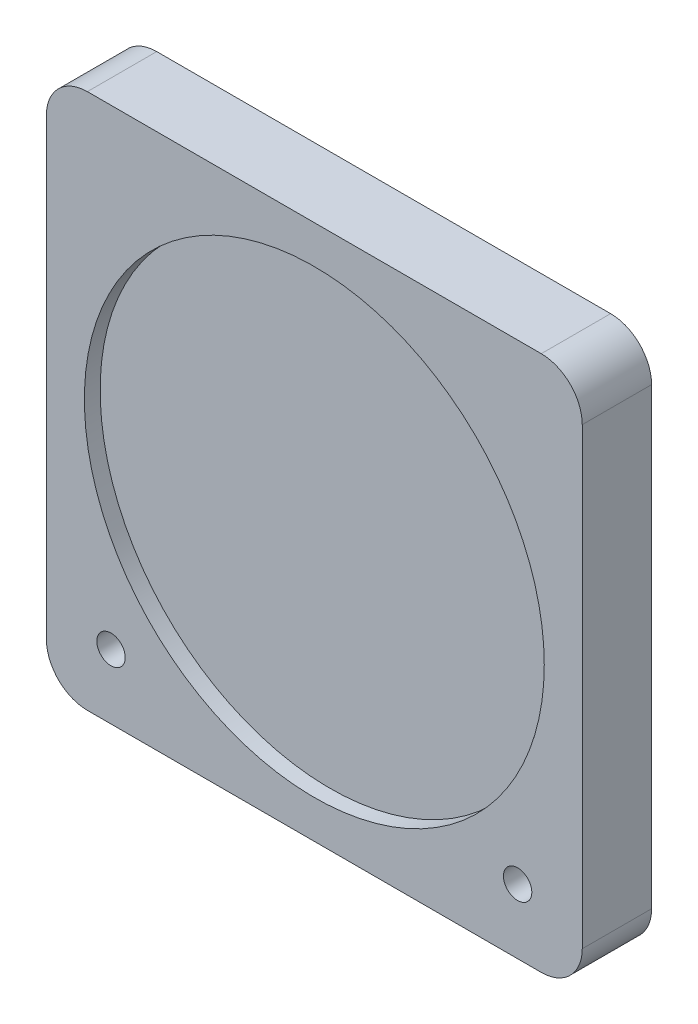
ISO-10303-21;
HEADER;
FILE_DESCRIPTION(('STEP AP214'),'2;1');
FILE_NAME('part.step','',(''),(''),'','','');
FILE_SCHEMA(('AUTOMOTIVE_DESIGN { 1 0 10303 214 1 1 1 1 }'));
ENDSEC;
DATA;
#1=APPLICATION_CONTEXT('core data for automotive mechanical design processes');
#2=APPLICATION_PROTOCOL_DEFINITION('international standard','automotive_design',2000,#1);
#3=PRODUCT_CONTEXT('',#1,'mechanical');
#4=PRODUCT('Part','Part','',(#3));
#5=PRODUCT_RELATED_PRODUCT_CATEGORY('part','',(#4));
#6=PRODUCT_DEFINITION_FORMATION('','',#4);
#7=PRODUCT_DEFINITION_CONTEXT('part definition',#1,'design');
#8=PRODUCT_DEFINITION('design','',#6,#7);
#9=PRODUCT_DEFINITION_SHAPE('','',#8);
#10=(LENGTH_UNIT() NAMED_UNIT(*) SI_UNIT(.MILLI.,.METRE.));
#11=(NAMED_UNIT(*) PLANE_ANGLE_UNIT() SI_UNIT($,.RADIAN.));
#12=(NAMED_UNIT(*) SI_UNIT($,.STERADIAN.) SOLID_ANGLE_UNIT());
#13=UNCERTAINTY_MEASURE_WITH_UNIT(LENGTH_MEASURE(1.E-05),#10,'distance_accuracy_value','');
#14=(GEOMETRIC_REPRESENTATION_CONTEXT(3) GLOBAL_UNCERTAINTY_ASSIGNED_CONTEXT((#13)) GLOBAL_UNIT_ASSIGNED_CONTEXT((#10,
#11,#12)) REPRESENTATION_CONTEXT('',''));
#15=CARTESIAN_POINT('',(0.,0.,0.));
#16=DIRECTION('',(0.,0.,1.));
#17=DIRECTION('',(1.,0.,0.));
#18=AXIS2_PLACEMENT_3D('',#15,#16,#17);
#19=CARTESIAN_POINT('',(0.,0.,22.));
#20=DIRECTION('',(1.,0.,0.));
#21=DIRECTION('',(0.,0.,-1.));
#22=AXIS2_PLACEMENT_3D('',#19,#20,#21);
#23=PLANE('',#22);
#24=DIRECTION('',(0.,-1.,0.));
#25=VECTOR('',#24,1.);
#26=CARTESIAN_POINT('',(0.,0.,0.));
#27=LINE('',#26,#25);
#28=CARTESIAN_POINT('',(0.,157.,0.));
#29=VERTEX_POINT('',#28);
#30=CARTESIAN_POINT('',(0.,13.,0.));
#31=VERTEX_POINT('',#30);
#32=EDGE_CURVE('E123',#29,#31,#27,.T.);
#33=ORIENTED_EDGE('',*,*,#32,.T.);
#34=DIRECTION('',(0.,0.,-1.));
#35=VECTOR('',#34,1.);
#36=CARTESIAN_POINT('',(0.,13.,22.));
#37=LINE('',#36,#35);
#38=CARTESIAN_POINT('',(0.,13.,22.));
#39=VERTEX_POINT('',#38);
#40=EDGE_CURVE('E101',#31,#39,#37,.F.);
#41=ORIENTED_EDGE('',*,*,#40,.T.);
#42=DIRECTION('',(0.,-1.,0.));
#43=VECTOR('',#42,1.);
#44=CARTESIAN_POINT('',(0.,0.,22.));
#45=LINE('',#44,#43);
#46=CARTESIAN_POINT('',(0.,157.,22.));
#47=VERTEX_POINT('',#46);
#48=EDGE_CURVE('E133',#47,#39,#45,.T.);
#49=ORIENTED_EDGE('',*,*,#48,.F.);
#50=DIRECTION('',(0.,0.,-1.));
#51=VECTOR('',#50,1.);
#52=CARTESIAN_POINT('',(0.,157.,22.));
#53=LINE('',#52,#51);
#54=EDGE_CURVE('E106',#47,#29,#53,.T.);
#55=ORIENTED_EDGE('',*,*,#54,.T.);
#56=EDGE_LOOP('',(#33,#41,#49,#55));
#57=FACE_BOUND('',#56,.T.);
#58=ADVANCED_FACE('F31',(#57),#23,.F.);
#59=CARTESIAN_POINT('',(0.,0.,22.));
#60=DIRECTION('',(0.,1.,0.));
#61=DIRECTION('',(0.,0.,1.));
#62=AXIS2_PLACEMENT_3D('',#59,#60,#61);
#63=PLANE('',#62);
#64=DIRECTION('',(1.,0.,0.));
#65=VECTOR('',#64,1.);
#66=CARTESIAN_POINT('',(0.,0.,22.));
#67=LINE('',#66,#65);
#68=CARTESIAN_POINT('',(13.,0.,22.));
#69=VERTEX_POINT('',#68);
#70=CARTESIAN_POINT('',(157.,0.,22.));
#71=VERTEX_POINT('',#70);
#72=EDGE_CURVE('E116',#69,#71,#67,.T.);
#73=ORIENTED_EDGE('',*,*,#72,.F.);
#74=DIRECTION('',(0.,0.,-1.));
#75=VECTOR('',#74,1.);
#76=CARTESIAN_POINT('',(13.,0.,22.));
#77=LINE('',#76,#75);
#78=CARTESIAN_POINT('',(13.,0.,0.));
#79=VERTEX_POINT('',#78);
#80=EDGE_CURVE('E100',#69,#79,#77,.T.);
#81=ORIENTED_EDGE('',*,*,#80,.T.);
#82=DIRECTION('',(1.,0.,0.));
#83=VECTOR('',#82,1.);
#84=CARTESIAN_POINT('',(0.,0.,0.));
#85=LINE('',#84,#83);
#86=CARTESIAN_POINT('',(157.,0.,0.));
#87=VERTEX_POINT('',#86);
#88=EDGE_CURVE('E113',#79,#87,#85,.T.);
#89=ORIENTED_EDGE('',*,*,#88,.T.);
#90=DIRECTION('',(0.,0.,-1.));
#91=VECTOR('',#90,1.);
#92=CARTESIAN_POINT('',(157.,0.,22.));
#93=LINE('',#92,#91);
#94=EDGE_CURVE('E118',#87,#71,#93,.F.);
#95=ORIENTED_EDGE('',*,*,#94,.T.);
#96=EDGE_LOOP('',(#73,#81,#89,#95));
#97=FACE_BOUND('',#96,.T.);
#98=ADVANCED_FACE('F112',(#97),#63,.F.);
#99=CARTESIAN_POINT('',(170.,0.,22.));
#100=DIRECTION('',(-1.,0.,0.));
#101=DIRECTION('',(0.,0.,1.));
#102=AXIS2_PLACEMENT_3D('',#99,#100,#101);
#103=PLANE('',#102);
#104=DIRECTION('',(0.,1.,0.));
#105=VECTOR('',#104,1.);
#106=CARTESIAN_POINT('',(170.,0.,22.));
#107=LINE('',#106,#105);
#108=CARTESIAN_POINT('',(170.,13.,22.));
#109=VERTEX_POINT('',#108);
#110=CARTESIAN_POINT('',(170.,157.,22.));
#111=VERTEX_POINT('',#110);
#112=EDGE_CURVE('E167',#109,#111,#107,.T.);
#113=ORIENTED_EDGE('',*,*,#112,.F.);
#114=DIRECTION('',(0.,0.,-1.));
#115=VECTOR('',#114,1.);
#116=CARTESIAN_POINT('',(170.,13.,22.));
#117=LINE('',#116,#115);
#118=CARTESIAN_POINT('',(170.,13.,0.));
#119=VERTEX_POINT('',#118);
#120=EDGE_CURVE('E152',#109,#119,#117,.T.);
#121=ORIENTED_EDGE('',*,*,#120,.T.);
#122=DIRECTION('',(0.,1.,0.));
#123=VECTOR('',#122,1.);
#124=CARTESIAN_POINT('',(170.,0.,0.));
#125=LINE('',#124,#123);
#126=CARTESIAN_POINT('',(170.,157.,0.));
#127=VERTEX_POINT('',#126);
#128=EDGE_CURVE('E122',#119,#127,#125,.T.);
#129=ORIENTED_EDGE('',*,*,#128,.T.);
#130=DIRECTION('',(0.,0.,-1.));
#131=VECTOR('',#130,1.);
#132=CARTESIAN_POINT('',(170.,157.,22.));
#133=LINE('',#132,#131);
#134=EDGE_CURVE('E150',#127,#111,#133,.F.);
#135=ORIENTED_EDGE('',*,*,#134,.T.);
#136=EDGE_LOOP('',(#113,#121,#129,#135));
#137=FACE_BOUND('',#136,.T.);
#138=ADVANCED_FACE('F182',(#137),#103,.F.);
#139=CARTESIAN_POINT('',(0.,170.,22.));
#140=DIRECTION('',(0.,-1.,0.));
#141=DIRECTION('',(0.,0.,-1.));
#142=AXIS2_PLACEMENT_3D('',#139,#140,#141);
#143=PLANE('',#142);
#144=DIRECTION('',(-1.,0.,0.));
#145=VECTOR('',#144,1.);
#146=CARTESIAN_POINT('',(0.,170.,0.));
#147=LINE('',#146,#145);
#148=CARTESIAN_POINT('',(157.,170.,0.));
#149=VERTEX_POINT('',#148);
#150=CARTESIAN_POINT('',(13.,170.,0.));
#151=VERTEX_POINT('',#150);
#152=EDGE_CURVE('E126',#149,#151,#147,.T.);
#153=ORIENTED_EDGE('',*,*,#152,.T.);
#154=DIRECTION('',(0.,0.,-1.));
#155=VECTOR('',#154,1.);
#156=CARTESIAN_POINT('',(13.,170.,22.));
#157=LINE('',#156,#155);
#158=CARTESIAN_POINT('',(13.,170.,22.));
#159=VERTEX_POINT('',#158);
#160=EDGE_CURVE('E11',#151,#159,#157,.F.);
#161=ORIENTED_EDGE('',*,*,#160,.T.);
#162=DIRECTION('',(-1.,0.,0.));
#163=VECTOR('',#162,1.);
#164=CARTESIAN_POINT('',(0.,170.,22.));
#165=LINE('',#164,#163);
#166=CARTESIAN_POINT('',(157.,170.,22.));
#167=VERTEX_POINT('',#166);
#168=EDGE_CURVE('E134',#167,#159,#165,.T.);
#169=ORIENTED_EDGE('',*,*,#168,.F.);
#170=DIRECTION('',(0.,0.,-1.));
#171=VECTOR('',#170,1.);
#172=CARTESIAN_POINT('',(157.,170.,22.));
#173=LINE('',#172,#171);
#174=EDGE_CURVE('E39',#167,#149,#173,.T.);
#175=ORIENTED_EDGE('',*,*,#174,.T.);
#176=EDGE_LOOP('',(#153,#161,#169,#175));
#177=FACE_BOUND('',#176,.T.);
#178=ADVANCED_FACE('F157',(#177),#143,.F.);
#179=CARTESIAN_POINT('',(0.,170.,22.));
#180=DIRECTION('',(0.,0.,-1.));
#181=DIRECTION('',(-1.,0.,0.));
#182=AXIS2_PLACEMENT_3D('',#179,#180,#181);
#183=PLANE('',#182);
#184=CARTESIAN_POINT('',(85.,85.,22.));
#185=DIRECTION('',(0.,0.,1.));
#186=DIRECTION('',(1.,0.,0.));
#187=AXIS2_PLACEMENT_3D('',#184,#185,#186);
#188=CIRCLE('',#187,72.95);
#189=CARTESIAN_POINT('',(157.95,85.,22.));
#190=VERTEX_POINT('',#189);
#191=EDGE_CURVE('E297',#190,#190,#188,.T.);
#192=ORIENTED_EDGE('',*,*,#191,.F.);
#193=EDGE_LOOP('',(#192));
#194=FACE_BOUND('',#193,.T.);
#195=CARTESIAN_POINT('',(20.5,20.5,22.));
#196=DIRECTION('',(0.,0.,1.));
#197=DIRECTION('',(1.,0.,0.));
#198=AXIS2_PLACEMENT_3D('',#195,#196,#197);
#199=CIRCLE('',#198,4.5);
#200=CARTESIAN_POINT('',(25.,20.5,22.));
#201=VERTEX_POINT('',#200);
#202=EDGE_CURVE('E296',#201,#201,#199,.T.);
#203=ORIENTED_EDGE('',*,*,#202,.F.);
#204=EDGE_LOOP('',(#203));
#205=FACE_BOUND('',#204,.T.);
#206=CARTESIAN_POINT('',(149.5,20.5,22.));
#207=DIRECTION('',(0.,0.,1.));
#208=DIRECTION('',(1.,0.,0.));
#209=AXIS2_PLACEMENT_3D('',#206,#207,#208);
#210=CIRCLE('',#209,4.5);
#211=CARTESIAN_POINT('',(154.,20.5,22.));
#212=VERTEX_POINT('',#211);
#213=EDGE_CURVE('E306',#212,#212,#210,.T.);
#214=ORIENTED_EDGE('',*,*,#213,.F.);
#215=EDGE_LOOP('',(#214));
#216=FACE_BOUND('',#215,.T.);
#217=ORIENTED_EDGE('',*,*,#48,.T.);
#218=CARTESIAN_POINT('',(13.,13.,22.));
#219=DIRECTION('',(0.,0.,-1.));
#220=DIRECTION('',(-1.,0.,0.));
#221=AXIS2_PLACEMENT_3D('',#218,#219,#220);
#222=CIRCLE('',#221,13.);
#223=EDGE_CURVE('E148',#39,#69,#222,.F.);
#224=ORIENTED_EDGE('',*,*,#223,.T.);
#225=ORIENTED_EDGE('',*,*,#72,.T.);
#226=CARTESIAN_POINT('',(157.,13.,22.));
#227=DIRECTION('',(0.,0.,-1.));
#228=DIRECTION('',(-1.,0.,0.));
#229=AXIS2_PLACEMENT_3D('',#226,#227,#228);
#230=CIRCLE('',#229,13.);
#231=EDGE_CURVE('E146',#71,#109,#230,.F.);
#232=ORIENTED_EDGE('',*,*,#231,.T.);
#233=ORIENTED_EDGE('',*,*,#112,.T.);
#234=CARTESIAN_POINT('',(157.,157.,22.));
#235=DIRECTION('',(0.,0.,-1.));
#236=DIRECTION('',(-1.,0.,0.));
#237=AXIS2_PLACEMENT_3D('',#234,#235,#236);
#238=CIRCLE('',#237,13.);
#239=EDGE_CURVE('E51',#111,#167,#238,.F.);
#240=ORIENTED_EDGE('',*,*,#239,.T.);
#241=ORIENTED_EDGE('',*,*,#168,.T.);
#242=CARTESIAN_POINT('',(13.,157.,22.));
#243=DIRECTION('',(0.,0.,-1.));
#244=DIRECTION('',(-1.,0.,0.));
#245=AXIS2_PLACEMENT_3D('',#242,#243,#244);
#246=CIRCLE('',#245,13.);
#247=EDGE_CURVE('E144',#159,#47,#246,.F.);
#248=ORIENTED_EDGE('',*,*,#247,.T.);
#249=EDGE_LOOP('',(#217,#224,#225,#232,#233,#240,#241,#248));
#250=FACE_BOUND('',#249,.T.);
#251=ADVANCED_FACE('F172',(#194,#205,#216,#250),#183,.F.);
#252=CARTESIAN_POINT('',(0.,170.,0.));
#253=DIRECTION('',(0.,0.,-1.));
#254=DIRECTION('',(-1.,0.,0.));
#255=AXIS2_PLACEMENT_3D('',#252,#253,#254);
#256=PLANE('',#255);
#257=CARTESIAN_POINT('',(20.5,20.5,0.));
#258=DIRECTION('',(0.,0.,-1.));
#259=DIRECTION('',(-1.,0.,0.));
#260=AXIS2_PLACEMENT_3D('',#257,#258,#259);
#261=CIRCLE('',#260,4.5);
#262=CARTESIAN_POINT('',(16.,20.5,0.));
#263=VERTEX_POINT('',#262);
#264=EDGE_CURVE('E300',#263,#263,#261,.T.);
#265=ORIENTED_EDGE('',*,*,#264,.F.);
#266=EDGE_LOOP('',(#265));
#267=FACE_BOUND('',#266,.T.);
#268=CARTESIAN_POINT('',(149.5,20.5,0.));
#269=DIRECTION('',(0.,0.,-1.));
#270=DIRECTION('',(-1.,0.,0.));
#271=AXIS2_PLACEMENT_3D('',#268,#269,#270);
#272=CIRCLE('',#271,4.5);
#273=CARTESIAN_POINT('',(145.,20.5,0.));
#274=VERTEX_POINT('',#273);
#275=EDGE_CURVE('E128',#274,#274,#272,.T.);
#276=ORIENTED_EDGE('',*,*,#275,.F.);
#277=EDGE_LOOP('',(#276));
#278=FACE_BOUND('',#277,.T.);
#279=ORIENTED_EDGE('',*,*,#88,.F.);
#280=CARTESIAN_POINT('',(13.,13.,0.));
#281=DIRECTION('',(0.,0.,-1.));
#282=DIRECTION('',(-1.,0.,0.));
#283=AXIS2_PLACEMENT_3D('',#280,#281,#282);
#284=CIRCLE('',#283,13.);
#285=EDGE_CURVE('E96',#79,#31,#284,.T.);
#286=ORIENTED_EDGE('',*,*,#285,.T.);
#287=ORIENTED_EDGE('',*,*,#32,.F.);
#288=CARTESIAN_POINT('',(13.,157.,0.));
#289=DIRECTION('',(0.,0.,-1.));
#290=DIRECTION('',(-1.,0.,0.));
#291=AXIS2_PLACEMENT_3D('',#288,#289,#290);
#292=CIRCLE('',#291,13.);
#293=EDGE_CURVE('E137',#29,#151,#292,.T.);
#294=ORIENTED_EDGE('',*,*,#293,.T.);
#295=ORIENTED_EDGE('',*,*,#152,.F.);
#296=CARTESIAN_POINT('',(157.,157.,0.));
#297=DIRECTION('',(0.,0.,-1.));
#298=DIRECTION('',(-1.,0.,0.));
#299=AXIS2_PLACEMENT_3D('',#296,#297,#298);
#300=CIRCLE('',#299,13.);
#301=EDGE_CURVE('E117',#149,#127,#300,.T.);
#302=ORIENTED_EDGE('',*,*,#301,.T.);
#303=ORIENTED_EDGE('',*,*,#128,.F.);
#304=CARTESIAN_POINT('',(157.,13.,0.));
#305=DIRECTION('',(0.,0.,-1.));
#306=DIRECTION('',(-1.,0.,0.));
#307=AXIS2_PLACEMENT_3D('',#304,#305,#306);
#308=CIRCLE('',#307,13.);
#309=EDGE_CURVE('E107',#119,#87,#308,.T.);
#310=ORIENTED_EDGE('',*,*,#309,.T.);
#311=EDGE_LOOP('',(#279,#286,#287,#294,#295,#302,#303,#310));
#312=FACE_BOUND('',#311,.T.);
#313=ADVANCED_FACE('F120',(#267,#278,#312),#256,.T.);
#314=CARTESIAN_POINT('',(13.,13.,22.));
#315=DIRECTION('',(0.,0.,-1.));
#316=DIRECTION('',(-1.,0.,0.));
#317=AXIS2_PLACEMENT_3D('',#314,#315,#316);
#318=CYLINDRICAL_SURFACE('',#317,13.);
#319=ORIENTED_EDGE('',*,*,#223,.F.);
#320=ORIENTED_EDGE('',*,*,#40,.F.);
#321=ORIENTED_EDGE('',*,*,#285,.F.);
#322=ORIENTED_EDGE('',*,*,#80,.F.);
#323=EDGE_LOOP('',(#319,#320,#321,#322));
#324=FACE_BOUND('',#323,.T.);
#325=ADVANCED_FACE('F99',(#324),#318,.T.);
#326=CARTESIAN_POINT('',(157.,13.,22.));
#327=DIRECTION('',(0.,0.,-1.));
#328=DIRECTION('',(-1.,0.,0.));
#329=AXIS2_PLACEMENT_3D('',#326,#327,#328);
#330=CYLINDRICAL_SURFACE('',#329,13.);
#331=ORIENTED_EDGE('',*,*,#231,.F.);
#332=ORIENTED_EDGE('',*,*,#94,.F.);
#333=ORIENTED_EDGE('',*,*,#309,.F.);
#334=ORIENTED_EDGE('',*,*,#120,.F.);
#335=EDGE_LOOP('',(#331,#332,#333,#334));
#336=FACE_BOUND('',#335,.T.);
#337=ADVANCED_FACE('F197',(#336),#330,.T.);
#338=CARTESIAN_POINT('',(13.,157.,22.));
#339=DIRECTION('',(0.,0.,-1.));
#340=DIRECTION('',(-1.,0.,0.));
#341=AXIS2_PLACEMENT_3D('',#338,#339,#340);
#342=CYLINDRICAL_SURFACE('',#341,13.);
#343=ORIENTED_EDGE('',*,*,#247,.F.);
#344=ORIENTED_EDGE('',*,*,#160,.F.);
#345=ORIENTED_EDGE('',*,*,#293,.F.);
#346=ORIENTED_EDGE('',*,*,#54,.F.);
#347=EDGE_LOOP('',(#343,#344,#345,#346));
#348=FACE_BOUND('',#347,.T.);
#349=ADVANCED_FACE('F162',(#348),#342,.T.);
#350=CARTESIAN_POINT('',(157.,157.,22.));
#351=DIRECTION('',(0.,0.,-1.));
#352=DIRECTION('',(-1.,0.,0.));
#353=AXIS2_PLACEMENT_3D('',#350,#351,#352);
#354=CYLINDRICAL_SURFACE('',#353,13.);
#355=ORIENTED_EDGE('',*,*,#239,.F.);
#356=ORIENTED_EDGE('',*,*,#134,.F.);
#357=ORIENTED_EDGE('',*,*,#301,.F.);
#358=ORIENTED_EDGE('',*,*,#174,.F.);
#359=EDGE_LOOP('',(#355,#356,#357,#358));
#360=FACE_BOUND('',#359,.T.);
#361=ADVANCED_FACE('F33',(#360),#354,.T.);
#362=CARTESIAN_POINT('',(149.5,20.5,22.));
#363=DIRECTION('',(0.,0.,1.));
#364=DIRECTION('',(1.,0.,0.));
#365=AXIS2_PLACEMENT_3D('',#362,#363,#364);
#366=CYLINDRICAL_SURFACE('',#365,4.5);
#367=ORIENTED_EDGE('',*,*,#213,.T.);
#368=EDGE_LOOP('',(#367));
#369=FACE_BOUND('',#368,.T.);
#370=ORIENTED_EDGE('',*,*,#275,.T.);
#371=EDGE_LOOP('',(#370));
#372=FACE_BOUND('',#371,.T.);
#373=ADVANCED_FACE('F204',(#369,#372),#366,.F.);
#374=CARTESIAN_POINT('',(20.5,20.5,22.));
#375=DIRECTION('',(0.,0.,1.));
#376=DIRECTION('',(1.,0.,0.));
#377=AXIS2_PLACEMENT_3D('',#374,#375,#376);
#378=CYLINDRICAL_SURFACE('',#377,4.5);
#379=ORIENTED_EDGE('',*,*,#202,.T.);
#380=EDGE_LOOP('',(#379));
#381=FACE_BOUND('',#380,.T.);
#382=ORIENTED_EDGE('',*,*,#264,.T.);
#383=EDGE_LOOP('',(#382));
#384=FACE_BOUND('',#383,.T.);
#385=ADVANCED_FACE('F208',(#381,#384),#378,.F.);
#386=CARTESIAN_POINT('',(85.,85.,17.));
#387=DIRECTION('',(0.,0.,1.));
#388=DIRECTION('',(1.,0.,0.));
#389=AXIS2_PLACEMENT_3D('',#386,#387,#388);
#390=CYLINDRICAL_SURFACE('',#389,72.95);
#391=CARTESIAN_POINT('',(85.,85.,17.));
#392=DIRECTION('',(0.,0.,1.));
#393=DIRECTION('',(1.,0.,0.));
#394=AXIS2_PLACEMENT_3D('',#391,#392,#393);
#395=CIRCLE('',#394,72.95);
#396=CARTESIAN_POINT('',(157.95,85.,17.));
#397=VERTEX_POINT('',#396);
#398=EDGE_CURVE('E295',#397,#397,#395,.T.);
#399=ORIENTED_EDGE('',*,*,#398,.F.);
#400=EDGE_LOOP('',(#399));
#401=FACE_BOUND('',#400,.T.);
#402=ORIENTED_EDGE('',*,*,#191,.T.);
#403=EDGE_LOOP('',(#402));
#404=FACE_BOUND('',#403,.T.);
#405=ADVANCED_FACE('F265',(#401,#404),#390,.F.);
#406=CARTESIAN_POINT('',(85.,85.,17.));
#407=DIRECTION('',(0.,0.,1.));
#408=DIRECTION('',(1.,0.,0.));
#409=AXIS2_PLACEMENT_3D('',#406,#407,#408);
#410=PLANE('',#409);
#411=ORIENTED_EDGE('',*,*,#398,.T.);
#412=EDGE_LOOP('',(#411));
#413=FACE_BOUND('',#412,.T.);
#414=ADVANCED_FACE('F279',(#413),#410,.T.);
#415=CLOSED_SHELL('',(#58,#98,#138,#178,#251,#313,#325,#337,#349,#361,#373,#385,#405,#414));
#416=MANIFOLD_SOLID_BREP('B2',#415);
#417=ADVANCED_BREP_SHAPE_REPRESENTATION('',(#18,#416),#14);
#418=SHAPE_DEFINITION_REPRESENTATION(#9,#417);
ENDSEC;
END-ISO-10303-21;
